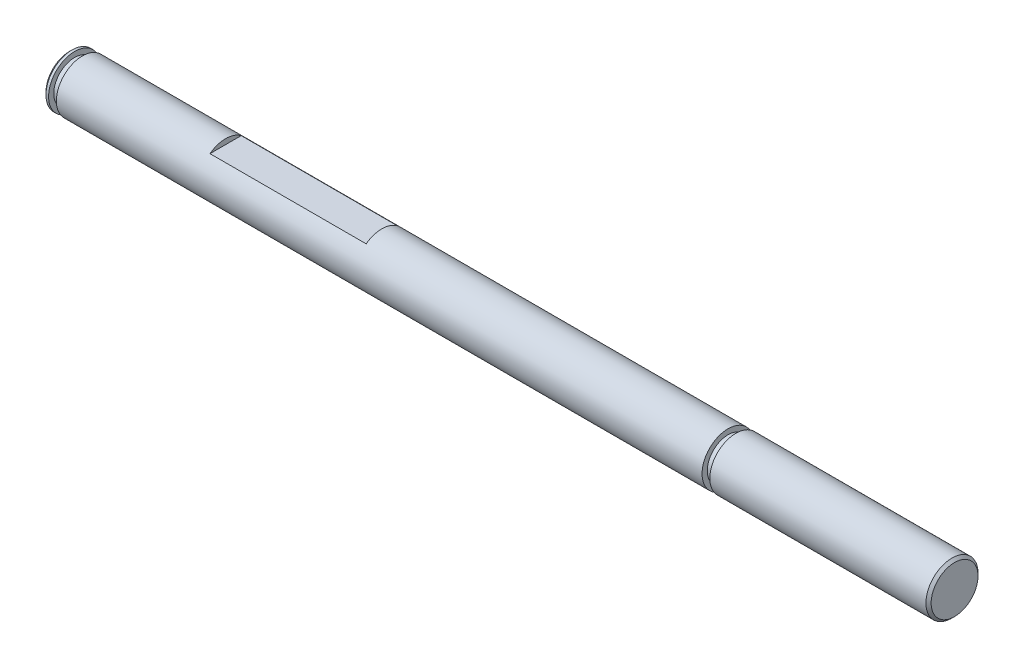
from build123d import *

# Parameters (mm, degrees)
SKETCH1_R           = 2.5
BOSS_EXTRUDE1_DEPTH = 85
CHAMFER1_SIZE       = 0.25
SKETCH2_W           = 0.75
SKETCH2_H           = 0.5
SKETCH4_W           = 15
SKETCH4_H           = 0.5
CUT_EXTRUDE1_DEPTH  = 5
CHAMFER2_SIZE       = 0.25


with BuildPart() as part:
    # Sketch1 → Boss-Extrude1 (new body)
    with BuildSketch(Plane(origin=(0, 0, 0), x_dir=(0, 0, -1), z_dir=(1, 0, 0))):
        Circle(SKETCH1_R)
    extrude(amount=BOSS_EXTRUDE1_DEPTH)

    # Chamfer1
    chamfer1_edges = [part.edges().sort_by_distance(p)[0] for p in [
        (0, 0, 2.5),
    ]]
    chamfer(chamfer1_edges, length=CHAMFER1_SIZE)

    # Sketch2 → Cut-Revolve1 (revolve, cut)
    with BuildSketch(Plane.XY, mode=Mode.PRIVATE) as cut_revolve1_sk:
        with Locations((0.875, 2.25)):
            Rectangle(SKETCH2_W, SKETCH2_H)
        with Locations((63.625, 2.25)):
            Rectangle(SKETCH2_W, SKETCH2_H)
    revolve(cut_revolve1_sk.sketch.rotate(Axis((-0.247613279, 0, 0), (-1, 0, 0)), 90), axis=Axis((-0.247613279, 0, 0), (-1, 0, 0)), mode=Mode.SUBTRACT)

    # Sketch4 → Cut-Extrude1 (cut, symmetric)
    with BuildSketch(Plane.XY):
        with Locations((22.5, 2.25)):
            Rectangle(SKETCH4_W, SKETCH4_H)
    extrude(amount=CUT_EXTRUDE1_DEPTH, both=True, mode=Mode.SUBTRACT)

    # Chamfer2
    chamfer2_edges = [part.edges().sort_by_distance(p)[0] for p in [
        (85, 0, 2.5),
    ]]
    chamfer(chamfer2_edges, length=CHAMFER2_SIZE)


solid = part.part
